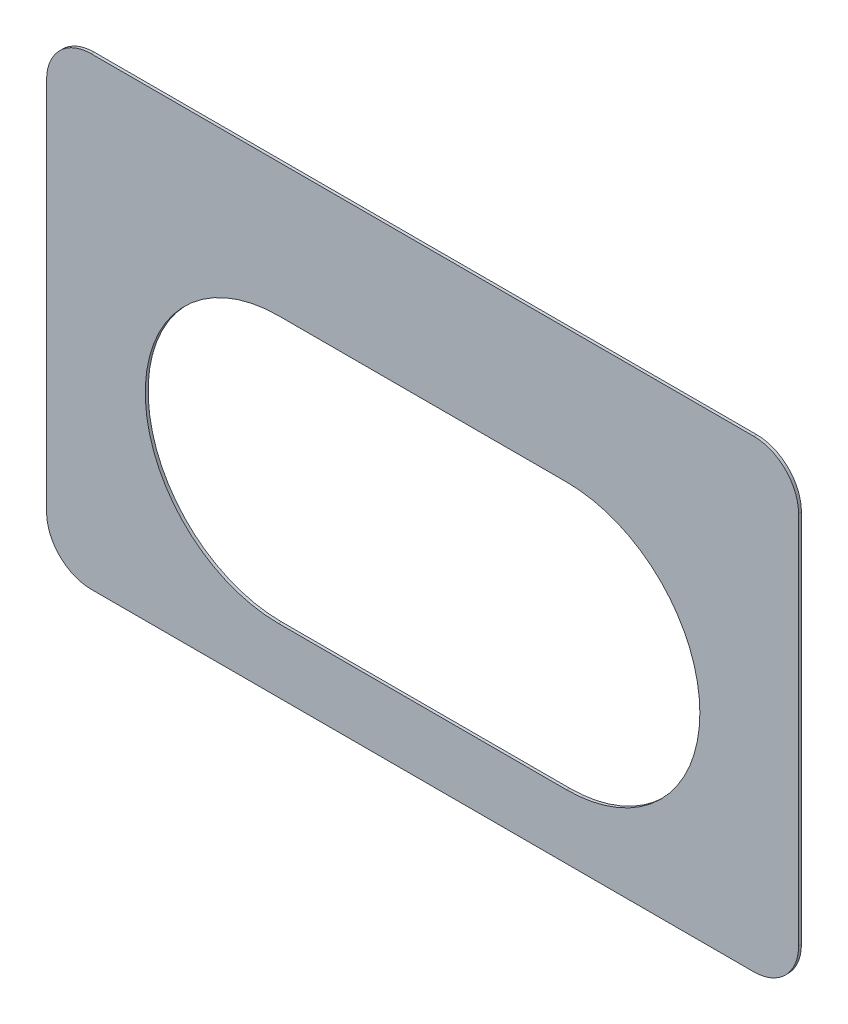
ISO-10303-21;
HEADER;
FILE_DESCRIPTION(('STEP AP214'),'2;1');
FILE_NAME('part.step','',(''),(''),'','','');
FILE_SCHEMA(('AUTOMOTIVE_DESIGN { 1 0 10303 214 1 1 1 1 }'));
ENDSEC;
DATA;
#1=APPLICATION_CONTEXT('core data for automotive mechanical design processes');
#2=APPLICATION_PROTOCOL_DEFINITION('international standard','automotive_design',2000,#1);
#3=PRODUCT_CONTEXT('',#1,'mechanical');
#4=PRODUCT('Part','Part','',(#3));
#5=PRODUCT_RELATED_PRODUCT_CATEGORY('part','',(#4));
#6=PRODUCT_DEFINITION_FORMATION('','',#4);
#7=PRODUCT_DEFINITION_CONTEXT('part definition',#1,'design');
#8=PRODUCT_DEFINITION('design','',#6,#7);
#9=PRODUCT_DEFINITION_SHAPE('','',#8);
#10=(LENGTH_UNIT() NAMED_UNIT(*) SI_UNIT(.MILLI.,.METRE.));
#11=(NAMED_UNIT(*) PLANE_ANGLE_UNIT() SI_UNIT($,.RADIAN.));
#12=(NAMED_UNIT(*) SI_UNIT($,.STERADIAN.) SOLID_ANGLE_UNIT());
#13=UNCERTAINTY_MEASURE_WITH_UNIT(LENGTH_MEASURE(1.E-05),#10,'distance_accuracy_value','');
#14=(GEOMETRIC_REPRESENTATION_CONTEXT(3) GLOBAL_UNCERTAINTY_ASSIGNED_CONTEXT((#13)) GLOBAL_UNIT_ASSIGNED_CONTEXT((#10,
#11,#12)) REPRESENTATION_CONTEXT('',''));
#15=CARTESIAN_POINT('',(0.,0.,0.));
#16=DIRECTION('',(0.,0.,1.));
#17=DIRECTION('',(1.,0.,0.));
#18=AXIS2_PLACEMENT_3D('',#15,#16,#17);
#19=CARTESIAN_POINT('',(12.4999999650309,3.75,8.));
#20=DIRECTION('',(0.,-1.,0.));
#21=DIRECTION('',(-1.,0.,0.));
#22=AXIS2_PLACEMENT_3D('',#19,#20,#21);
#23=PLANE('',#22);
#24=DIRECTION('',(1.,0.,0.));
#25=VECTOR('',#24,1.);
#26=CARTESIAN_POINT('',(12.4999999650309,3.75,8.2));
#27=LINE('',#26,#25);
#28=CARTESIAN_POINT('',(12.4999999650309,3.75,8.2));
#29=VERTEX_POINT('',#28);
#30=CARTESIAN_POINT('',(32.4999999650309,3.75,8.2));
#31=VERTEX_POINT('',#30);
#32=EDGE_CURVE('E242',#29,#31,#27,.T.);
#33=ORIENTED_EDGE('',*,*,#32,.T.);
#34=DIRECTION('',(0.,0.,1.));
#35=VECTOR('',#34,1.);
#36=CARTESIAN_POINT('',(32.4999999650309,3.75,8.));
#37=LINE('',#36,#35);
#38=CARTESIAN_POINT('',(32.4999999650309,3.75,8.));
#39=VERTEX_POINT('',#38);
#40=EDGE_CURVE('E11',#39,#31,#37,.T.);
#41=ORIENTED_EDGE('',*,*,#40,.F.);
#42=DIRECTION('',(1.,0.,0.));
#43=VECTOR('',#42,1.);
#44=CARTESIAN_POINT('',(12.4999999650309,3.75,8.));
#45=LINE('',#44,#43);
#46=CARTESIAN_POINT('',(12.4999999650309,3.75,8.));
#47=VERTEX_POINT('',#46);
#48=EDGE_CURVE('E162',#47,#39,#45,.T.);
#49=ORIENTED_EDGE('',*,*,#48,.F.);
#50=DIRECTION('',(0.,0.,1.));
#51=VECTOR('',#50,1.);
#52=CARTESIAN_POINT('',(12.4999999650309,3.75,8.));
#53=LINE('',#52,#51);
#54=EDGE_CURVE('E47',#47,#29,#53,.T.);
#55=ORIENTED_EDGE('',*,*,#54,.T.);
#56=EDGE_LOOP('',(#33,#41,#49,#55));
#57=FACE_BOUND('',#56,.T.);
#58=ADVANCED_FACE('F17',(#57),#23,.F.);
#59=CARTESIAN_POINT('',(32.4999999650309,13.,8.));
#60=DIRECTION('',(0.,0.,1.));
#61=DIRECTION('',(1.,0.,0.));
#62=AXIS2_PLACEMENT_3D('',#59,#60,#61);
#63=CYLINDRICAL_SURFACE('',#62,9.25);
#64=DIRECTION('',(0.,0.,1.));
#65=VECTOR('',#64,1.);
#66=CARTESIAN_POINT('',(41.7499999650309,13.,8.));
#67=LINE('',#66,#65);
#68=CARTESIAN_POINT('',(41.7499999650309,13.,8.));
#69=VERTEX_POINT('',#68);
#70=CARTESIAN_POINT('',(41.7499999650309,13.,8.2));
#71=VERTEX_POINT('',#70);
#72=EDGE_CURVE('E431',#69,#71,#67,.T.);
#73=ORIENTED_EDGE('',*,*,#72,.F.);
#74=CARTESIAN_POINT('',(32.4999999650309,13.,8.));
#75=DIRECTION('',(0.,0.,1.));
#76=DIRECTION('',(1.,0.,0.));
#77=AXIS2_PLACEMENT_3D('',#74,#75,#76);
#78=CIRCLE('',#77,9.25);
#79=EDGE_CURVE('E187',#39,#69,#78,.T.);
#80=ORIENTED_EDGE('',*,*,#79,.F.);
#81=ORIENTED_EDGE('',*,*,#40,.T.);
#82=CARTESIAN_POINT('',(32.4999999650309,13.,8.2));
#83=DIRECTION('',(0.,0.,1.));
#84=DIRECTION('',(1.,0.,0.));
#85=AXIS2_PLACEMENT_3D('',#82,#83,#84);
#86=CIRCLE('',#85,9.25);
#87=EDGE_CURVE('E239',#31,#71,#86,.T.);
#88=ORIENTED_EDGE('',*,*,#87,.T.);
#89=EDGE_LOOP('',(#73,#80,#81,#88));
#90=FACE_BOUND('',#89,.T.);
#91=ADVANCED_FACE('F19',(#90),#63,.F.);
#92=CARTESIAN_POINT('',(12.4999999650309,22.25,8.));
#93=DIRECTION('',(0.,1.,0.));
#94=DIRECTION('',(1.,0.,0.));
#95=AXIS2_PLACEMENT_3D('',#92,#93,#94);
#96=PLANE('',#95);
#97=DIRECTION('',(-1.,0.,0.));
#98=VECTOR('',#97,1.);
#99=CARTESIAN_POINT('',(12.4999999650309,22.25,8.2));
#100=LINE('',#99,#98);
#101=CARTESIAN_POINT('',(32.4999999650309,22.25,8.2));
#102=VERTEX_POINT('',#101);
#103=CARTESIAN_POINT('',(12.4999999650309,22.25,8.2));
#104=VERTEX_POINT('',#103);
#105=EDGE_CURVE('E151',#102,#104,#100,.T.);
#106=ORIENTED_EDGE('',*,*,#105,.T.);
#107=DIRECTION('',(0.,0.,1.));
#108=VECTOR('',#107,1.);
#109=CARTESIAN_POINT('',(12.4999999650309,22.25,8.));
#110=LINE('',#109,#108);
#111=CARTESIAN_POINT('',(12.4999999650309,22.25,8.));
#112=VERTEX_POINT('',#111);
#113=EDGE_CURVE('E26',#112,#104,#110,.T.);
#114=ORIENTED_EDGE('',*,*,#113,.F.);
#115=DIRECTION('',(-1.,0.,0.));
#116=VECTOR('',#115,1.);
#117=CARTESIAN_POINT('',(12.4999999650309,22.25,8.));
#118=LINE('',#117,#116);
#119=CARTESIAN_POINT('',(32.4999999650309,22.25,8.));
#120=VERTEX_POINT('',#119);
#121=EDGE_CURVE('E149',#120,#112,#118,.T.);
#122=ORIENTED_EDGE('',*,*,#121,.F.);
#123=DIRECTION('',(0.,0.,1.));
#124=VECTOR('',#123,1.);
#125=CARTESIAN_POINT('',(32.4999999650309,22.25,8.));
#126=LINE('',#125,#124);
#127=EDGE_CURVE('E416',#120,#102,#126,.T.);
#128=ORIENTED_EDGE('',*,*,#127,.T.);
#129=EDGE_LOOP('',(#106,#114,#122,#128));
#130=FACE_BOUND('',#129,.T.);
#131=ADVANCED_FACE('F146',(#130),#96,.F.);
#132=CARTESIAN_POINT('',(12.4999999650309,13.,8.));
#133=DIRECTION('',(0.,0.,1.));
#134=DIRECTION('',(1.,0.,0.));
#135=AXIS2_PLACEMENT_3D('',#132,#133,#134);
#136=CYLINDRICAL_SURFACE('',#135,9.25);
#137=CARTESIAN_POINT('',(12.4999999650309,13.,8.2));
#138=DIRECTION('',(0.,0.,1.));
#139=DIRECTION('',(1.,0.,0.));
#140=AXIS2_PLACEMENT_3D('',#137,#138,#139);
#141=CIRCLE('',#140,9.25);
#142=EDGE_CURVE('E234',#104,#29,#141,.T.);
#143=ORIENTED_EDGE('',*,*,#142,.T.);
#144=ORIENTED_EDGE('',*,*,#54,.F.);
#145=CARTESIAN_POINT('',(12.4999999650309,13.,8.));
#146=DIRECTION('',(0.,0.,1.));
#147=DIRECTION('',(1.,0.,0.));
#148=AXIS2_PLACEMENT_3D('',#145,#146,#147);
#149=CIRCLE('',#148,9.25);
#150=EDGE_CURVE('E157',#112,#47,#149,.T.);
#151=ORIENTED_EDGE('',*,*,#150,.F.);
#152=ORIENTED_EDGE('',*,*,#113,.T.);
#153=EDGE_LOOP('',(#143,#144,#151,#152));
#154=FACE_BOUND('',#153,.T.);
#155=ADVANCED_FACE('F158',(#154),#136,.F.);
#156=CARTESIAN_POINT('',(-0.500000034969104,2.4,8.2));
#157=DIRECTION('',(0.,0.,1.));
#158=DIRECTION('',(1.,0.,0.));
#159=AXIS2_PLACEMENT_3D('',#156,#157,#158);
#160=PLANE('',#159);
#161=ORIENTED_EDGE('',*,*,#142,.F.);
#162=ORIENTED_EDGE('',*,*,#105,.F.);
#163=CARTESIAN_POINT('',(32.4999999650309,13.,8.2));
#164=DIRECTION('',(0.,0.,1.));
#165=DIRECTION('',(1.,0.,0.));
#166=AXIS2_PLACEMENT_3D('',#163,#164,#165);
#167=CIRCLE('',#166,9.25);
#168=EDGE_CURVE('E423',#71,#102,#167,.T.);
#169=ORIENTED_EDGE('',*,*,#168,.F.);
#170=ORIENTED_EDGE('',*,*,#87,.F.);
#171=ORIENTED_EDGE('',*,*,#32,.F.);
#172=EDGE_LOOP('',(#161,#162,#169,#170,#171));
#173=FACE_BOUND('',#172,.T.);
#174=DIRECTION('',(1.,0.,0.));
#175=VECTOR('',#174,1.);
#176=CARTESIAN_POINT('',(45.4999999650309,31.5,8.2));
#177=LINE('',#176,#175);
#178=CARTESIAN_POINT('',(-0.500000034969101,31.5,8.2));
#179=VERTEX_POINT('',#178);
#180=CARTESIAN_POINT('',(45.4999999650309,31.5,8.2));
#181=VERTEX_POINT('',#180);
#182=EDGE_CURVE('E198',#179,#181,#177,.T.);
#183=ORIENTED_EDGE('',*,*,#182,.F.);
#184=CARTESIAN_POINT('',(-0.500000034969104,28.4,8.2));
#185=DIRECTION('',(0.,0.,-1.));
#186=DIRECTION('',(1.,0.,0.));
#187=AXIS2_PLACEMENT_3D('',#184,#185,#186);
#188=CIRCLE('',#187,3.1);
#189=CARTESIAN_POINT('',(-3.6000000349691,28.4,8.2));
#190=VERTEX_POINT('',#189);
#191=EDGE_CURVE('E194',#190,#179,#188,.T.);
#192=ORIENTED_EDGE('',*,*,#191,.F.);
#193=DIRECTION('',(0.,1.,0.));
#194=VECTOR('',#193,1.);
#195=CARTESIAN_POINT('',(-3.6000000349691,28.4,8.2));
#196=LINE('',#195,#194);
#197=CARTESIAN_POINT('',(-3.6000000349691,2.4,8.2));
#198=VERTEX_POINT('',#197);
#199=EDGE_CURVE('E186',#198,#190,#196,.T.);
#200=ORIENTED_EDGE('',*,*,#199,.F.);
#201=CARTESIAN_POINT('',(-0.500000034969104,2.4,8.2));
#202=DIRECTION('',(0.,0.,-1.));
#203=DIRECTION('',(1.,0.,0.));
#204=AXIS2_PLACEMENT_3D('',#201,#202,#203);
#205=CIRCLE('',#204,3.1);
#206=CARTESIAN_POINT('',(-0.500000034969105,-0.699999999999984,8.2));
#207=VERTEX_POINT('',#206);
#208=EDGE_CURVE('E231',#207,#198,#205,.T.);
#209=ORIENTED_EDGE('',*,*,#208,.F.);
#210=DIRECTION('',(-1.,0.,0.));
#211=VECTOR('',#210,1.);
#212=CARTESIAN_POINT('',(-0.500000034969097,-0.699999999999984,8.2));
#213=LINE('',#212,#211);
#214=CARTESIAN_POINT('',(45.4999999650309,-0.69999999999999,8.2));
#215=VERTEX_POINT('',#214);
#216=EDGE_CURVE('E224',#215,#207,#213,.T.);
#217=ORIENTED_EDGE('',*,*,#216,.F.);
#218=CARTESIAN_POINT('',(45.4999999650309,2.4,8.2));
#219=DIRECTION('',(0.,0.,-1.));
#220=DIRECTION('',(1.,0.,0.));
#221=AXIS2_PLACEMENT_3D('',#218,#219,#220);
#222=CIRCLE('',#221,3.1);
#223=CARTESIAN_POINT('',(48.5999999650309,2.4,8.2));
#224=VERTEX_POINT('',#223);
#225=EDGE_CURVE('E213',#224,#215,#222,.T.);
#226=ORIENTED_EDGE('',*,*,#225,.F.);
#227=DIRECTION('',(0.,-1.,0.));
#228=VECTOR('',#227,1.);
#229=CARTESIAN_POINT('',(48.5999999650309,2.4,8.2));
#230=LINE('',#229,#228);
#231=CARTESIAN_POINT('',(48.5999999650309,28.4,8.2));
#232=VERTEX_POINT('',#231);
#233=EDGE_CURVE('E214',#232,#224,#230,.T.);
#234=ORIENTED_EDGE('',*,*,#233,.F.);
#235=CARTESIAN_POINT('',(45.4999999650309,28.4,8.2));
#236=DIRECTION('',(0.,0.,-1.));
#237=DIRECTION('',(1.,0.,0.));
#238=AXIS2_PLACEMENT_3D('',#235,#236,#237);
#239=CIRCLE('',#238,3.1);
#240=EDGE_CURVE('E205',#181,#232,#239,.T.);
#241=ORIENTED_EDGE('',*,*,#240,.F.);
#242=EDGE_LOOP('',(#183,#192,#200,#209,#217,#226,#234,#241));
#243=FACE_BOUND('',#242,.T.);
#244=ADVANCED_FACE('F471',(#173,#243),#160,.T.);
#245=CARTESIAN_POINT('',(-0.500000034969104,2.4,8.));
#246=DIRECTION('',(0.,0.,1.));
#247=DIRECTION('',(1.,0.,0.));
#248=AXIS2_PLACEMENT_3D('',#245,#246,#247);
#249=CYLINDRICAL_SURFACE('',#248,3.1);
#250=CARTESIAN_POINT('',(-0.500000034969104,2.4,8.));
#251=DIRECTION('',(0.,0.,1.));
#252=DIRECTION('',(1.,0.,0.));
#253=AXIS2_PLACEMENT_3D('',#250,#251,#252);
#254=CIRCLE('',#253,3.1);
#255=CARTESIAN_POINT('',(-3.6000000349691,2.4,8.));
#256=VERTEX_POINT('',#255);
#257=CARTESIAN_POINT('',(-0.500000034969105,-0.699999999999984,8.));
#258=VERTEX_POINT('',#257);
#259=EDGE_CURVE('E177',#256,#258,#254,.T.);
#260=ORIENTED_EDGE('',*,*,#259,.T.);
#261=DIRECTION('',(0.,0.,-1.));
#262=VECTOR('',#261,1.);
#263=CARTESIAN_POINT('',(-0.500000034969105,-0.699999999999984,8.));
#264=LINE('',#263,#262);
#265=EDGE_CURVE('E228',#207,#258,#264,.T.);
#266=ORIENTED_EDGE('',*,*,#265,.F.);
#267=ORIENTED_EDGE('',*,*,#208,.T.);
#268=DIRECTION('',(0.,0.,1.));
#269=VECTOR('',#268,1.);
#270=CARTESIAN_POINT('',(-3.6000000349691,2.4,8.));
#271=LINE('',#270,#269);
#272=EDGE_CURVE('E182',#256,#198,#271,.T.);
#273=ORIENTED_EDGE('',*,*,#272,.F.);
#274=EDGE_LOOP('',(#260,#266,#267,#273));
#275=FACE_BOUND('',#274,.T.);
#276=ADVANCED_FACE('F483',(#275),#249,.T.);
#277=CARTESIAN_POINT('',(-0.500000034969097,-0.699999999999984,8.));
#278=DIRECTION('',(0.,-1.,0.));
#279=DIRECTION('',(-1.,0.,0.));
#280=AXIS2_PLACEMENT_3D('',#277,#278,#279);
#281=PLANE('',#280);
#282=DIRECTION('',(1.,0.,0.));
#283=VECTOR('',#282,1.);
#284=CARTESIAN_POINT('',(-0.500000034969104,-0.699999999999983,8.));
#285=LINE('',#284,#283);
#286=CARTESIAN_POINT('',(45.4999999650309,-0.699999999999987,8.));
#287=VERTEX_POINT('',#286);
#288=EDGE_CURVE('E370',#258,#287,#285,.T.);
#289=ORIENTED_EDGE('',*,*,#288,.T.);
#290=DIRECTION('',(0.,0.,-1.));
#291=VECTOR('',#290,1.);
#292=CARTESIAN_POINT('',(45.4999999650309,-0.69999999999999,8.));
#293=LINE('',#292,#291);
#294=EDGE_CURVE('E221',#215,#287,#293,.T.);
#295=ORIENTED_EDGE('',*,*,#294,.F.);
#296=ORIENTED_EDGE('',*,*,#216,.T.);
#297=ORIENTED_EDGE('',*,*,#265,.T.);
#298=EDGE_LOOP('',(#289,#295,#296,#297));
#299=FACE_BOUND('',#298,.T.);
#300=ADVANCED_FACE('F488',(#299),#281,.T.);
#301=CARTESIAN_POINT('',(45.4999999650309,2.4,8.));
#302=DIRECTION('',(0.,0.,1.));
#303=DIRECTION('',(1.,0.,0.));
#304=AXIS2_PLACEMENT_3D('',#301,#302,#303);
#305=CYLINDRICAL_SURFACE('',#304,3.1);
#306=CARTESIAN_POINT('',(45.4999999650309,2.4,8.));
#307=DIRECTION('',(0.,0.,1.));
#308=DIRECTION('',(1.,0.,0.));
#309=AXIS2_PLACEMENT_3D('',#306,#307,#308);
#310=CIRCLE('',#309,3.1);
#311=CARTESIAN_POINT('',(48.5999999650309,2.4,8.));
#312=VERTEX_POINT('',#311);
#313=EDGE_CURVE('E378',#287,#312,#310,.T.);
#314=ORIENTED_EDGE('',*,*,#313,.T.);
#315=DIRECTION('',(0.,0.,-1.));
#316=VECTOR('',#315,1.);
#317=CARTESIAN_POINT('',(48.5999999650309,2.4,8.));
#318=LINE('',#317,#316);
#319=EDGE_CURVE('E210',#224,#312,#318,.T.);
#320=ORIENTED_EDGE('',*,*,#319,.F.);
#321=ORIENTED_EDGE('',*,*,#225,.T.);
#322=ORIENTED_EDGE('',*,*,#294,.T.);
#323=EDGE_LOOP('',(#314,#320,#321,#322));
#324=FACE_BOUND('',#323,.T.);
#325=ADVANCED_FACE('F484',(#324),#305,.T.);
#326=CARTESIAN_POINT('',(48.5999999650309,2.4,8.));
#327=DIRECTION('',(1.,0.,0.));
#328=DIRECTION('',(0.,1.,0.));
#329=AXIS2_PLACEMENT_3D('',#326,#327,#328);
#330=PLANE('',#329);
#331=DIRECTION('',(0.,1.,0.));
#332=VECTOR('',#331,1.);
#333=CARTESIAN_POINT('',(48.5999999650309,2.4,8.));
#334=LINE('',#333,#332);
#335=CARTESIAN_POINT('',(48.5999999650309,28.4,8.));
#336=VERTEX_POINT('',#335);
#337=EDGE_CURVE('E386',#312,#336,#334,.T.);
#338=ORIENTED_EDGE('',*,*,#337,.T.);
#339=DIRECTION('',(0.,0.,-1.));
#340=VECTOR('',#339,1.);
#341=CARTESIAN_POINT('',(48.5999999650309,28.4,8.));
#342=LINE('',#341,#340);
#343=EDGE_CURVE('E209',#232,#336,#342,.T.);
#344=ORIENTED_EDGE('',*,*,#343,.F.);
#345=ORIENTED_EDGE('',*,*,#233,.T.);
#346=ORIENTED_EDGE('',*,*,#319,.T.);
#347=EDGE_LOOP('',(#338,#344,#345,#346));
#348=FACE_BOUND('',#347,.T.);
#349=ADVANCED_FACE('F487',(#348),#330,.T.);
#350=CARTESIAN_POINT('',(45.4999999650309,28.4,8.));
#351=DIRECTION('',(0.,0.,1.));
#352=DIRECTION('',(1.,0.,0.));
#353=AXIS2_PLACEMENT_3D('',#350,#351,#352);
#354=CYLINDRICAL_SURFACE('',#353,3.1);
#355=CARTESIAN_POINT('',(45.4999999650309,28.4,8.));
#356=DIRECTION('',(0.,0.,1.));
#357=DIRECTION('',(1.,0.,0.));
#358=AXIS2_PLACEMENT_3D('',#355,#356,#357);
#359=CIRCLE('',#358,3.1);
#360=CARTESIAN_POINT('',(45.4999999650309,31.5,8.));
#361=VERTEX_POINT('',#360);
#362=EDGE_CURVE('E393',#336,#361,#359,.T.);
#363=ORIENTED_EDGE('',*,*,#362,.T.);
#364=DIRECTION('',(0.,0.,-1.));
#365=VECTOR('',#364,1.);
#366=CARTESIAN_POINT('',(45.4999999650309,31.5,8.));
#367=LINE('',#366,#365);
#368=EDGE_CURVE('E202',#181,#361,#367,.T.);
#369=ORIENTED_EDGE('',*,*,#368,.F.);
#370=ORIENTED_EDGE('',*,*,#240,.T.);
#371=ORIENTED_EDGE('',*,*,#343,.T.);
#372=EDGE_LOOP('',(#363,#369,#370,#371));
#373=FACE_BOUND('',#372,.T.);
#374=ADVANCED_FACE('F507',(#373),#354,.T.);
#375=CARTESIAN_POINT('',(45.4999999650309,31.5,8.));
#376=DIRECTION('',(0.,1.,0.));
#377=DIRECTION('',(1.,0.,0.));
#378=AXIS2_PLACEMENT_3D('',#375,#376,#377);
#379=PLANE('',#378);
#380=DIRECTION('',(-1.,0.,0.));
#381=VECTOR('',#380,1.);
#382=CARTESIAN_POINT('',(-0.500000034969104,31.5,8.));
#383=LINE('',#382,#381);
#384=CARTESIAN_POINT('',(-0.500000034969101,31.5,8.));
#385=VERTEX_POINT('',#384);
#386=EDGE_CURVE('E400',#361,#385,#383,.T.);
#387=ORIENTED_EDGE('',*,*,#386,.T.);
#388=DIRECTION('',(0.,0.,-1.));
#389=VECTOR('',#388,1.);
#390=CARTESIAN_POINT('',(-0.500000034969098,31.5,8.));
#391=LINE('',#390,#389);
#392=EDGE_CURVE('E195',#179,#385,#391,.T.);
#393=ORIENTED_EDGE('',*,*,#392,.F.);
#394=ORIENTED_EDGE('',*,*,#182,.T.);
#395=ORIENTED_EDGE('',*,*,#368,.T.);
#396=EDGE_LOOP('',(#387,#393,#394,#395));
#397=FACE_BOUND('',#396,.T.);
#398=ADVANCED_FACE('F503',(#397),#379,.T.);
#399=CARTESIAN_POINT('',(-0.500000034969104,28.4,8.));
#400=DIRECTION('',(0.,0.,1.));
#401=DIRECTION('',(1.,0.,0.));
#402=AXIS2_PLACEMENT_3D('',#399,#400,#401);
#403=CYLINDRICAL_SURFACE('',#402,3.1);
#404=CARTESIAN_POINT('',(-0.500000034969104,28.4,8.));
#405=DIRECTION('',(0.,0.,1.));
#406=DIRECTION('',(1.,0.,0.));
#407=AXIS2_PLACEMENT_3D('',#404,#405,#406);
#408=CIRCLE('',#407,3.1);
#409=CARTESIAN_POINT('',(-3.6000000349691,28.4,8.));
#410=VERTEX_POINT('',#409);
#411=EDGE_CURVE('E408',#385,#410,#408,.T.);
#412=ORIENTED_EDGE('',*,*,#411,.T.);
#413=DIRECTION('',(0.,0.,-1.));
#414=VECTOR('',#413,1.);
#415=CARTESIAN_POINT('',(-3.6000000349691,28.4,8.));
#416=LINE('',#415,#414);
#417=EDGE_CURVE('E191',#190,#410,#416,.T.);
#418=ORIENTED_EDGE('',*,*,#417,.F.);
#419=ORIENTED_EDGE('',*,*,#191,.T.);
#420=ORIENTED_EDGE('',*,*,#392,.T.);
#421=EDGE_LOOP('',(#412,#418,#419,#420));
#422=FACE_BOUND('',#421,.T.);
#423=ADVANCED_FACE('F497',(#422),#403,.T.);
#424=CARTESIAN_POINT('',(-3.6000000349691,28.4,8.));
#425=DIRECTION('',(-1.,0.,0.));
#426=DIRECTION('',(0.,0.,1.));
#427=AXIS2_PLACEMENT_3D('',#424,#425,#426);
#428=PLANE('',#427);
#429=DIRECTION('',(0.,-1.,0.));
#430=VECTOR('',#429,1.);
#431=CARTESIAN_POINT('',(-3.6000000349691,2.4,8.));
#432=LINE('',#431,#430);
#433=EDGE_CURVE('E170',#410,#256,#432,.T.);
#434=ORIENTED_EDGE('',*,*,#433,.T.);
#435=ORIENTED_EDGE('',*,*,#272,.T.);
#436=ORIENTED_EDGE('',*,*,#199,.T.);
#437=ORIENTED_EDGE('',*,*,#417,.T.);
#438=EDGE_LOOP('',(#434,#435,#436,#437));
#439=FACE_BOUND('',#438,.T.);
#440=ADVANCED_FACE('F494',(#439),#428,.T.);
#441=CARTESIAN_POINT('',(-0.500000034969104,2.4,8.));
#442=DIRECTION('',(0.,0.,1.));
#443=DIRECTION('',(1.,0.,0.));
#444=AXIS2_PLACEMENT_3D('',#441,#442,#443);
#445=PLANE('',#444);
#446=ORIENTED_EDGE('',*,*,#121,.T.);
#447=ORIENTED_EDGE('',*,*,#150,.T.);
#448=ORIENTED_EDGE('',*,*,#48,.T.);
#449=ORIENTED_EDGE('',*,*,#79,.T.);
#450=CARTESIAN_POINT('',(32.4999999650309,13.,8.));
#451=DIRECTION('',(0.,0.,1.));
#452=DIRECTION('',(1.,0.,0.));
#453=AXIS2_PLACEMENT_3D('',#450,#451,#452);
#454=CIRCLE('',#453,9.25);
#455=EDGE_CURVE('E168',#69,#120,#454,.T.);
#456=ORIENTED_EDGE('',*,*,#455,.T.);
#457=EDGE_LOOP('',(#446,#447,#448,#449,#456));
#458=FACE_BOUND('',#457,.T.);
#459=ORIENTED_EDGE('',*,*,#411,.F.);
#460=ORIENTED_EDGE('',*,*,#386,.F.);
#461=ORIENTED_EDGE('',*,*,#362,.F.);
#462=ORIENTED_EDGE('',*,*,#337,.F.);
#463=ORIENTED_EDGE('',*,*,#313,.F.);
#464=ORIENTED_EDGE('',*,*,#288,.F.);
#465=ORIENTED_EDGE('',*,*,#259,.F.);
#466=ORIENTED_EDGE('',*,*,#433,.F.);
#467=EDGE_LOOP('',(#459,#460,#461,#462,#463,#464,#465,#466));
#468=FACE_BOUND('',#467,.T.);
#469=ADVANCED_FACE('F165',(#458,#468),#445,.F.);
#470=CARTESIAN_POINT('',(32.4999999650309,13.,8.));
#471=DIRECTION('',(0.,0.,1.));
#472=DIRECTION('',(1.,0.,0.));
#473=AXIS2_PLACEMENT_3D('',#470,#471,#472);
#474=CYLINDRICAL_SURFACE('',#473,9.25);
#475=ORIENTED_EDGE('',*,*,#455,.F.);
#476=ORIENTED_EDGE('',*,*,#72,.T.);
#477=ORIENTED_EDGE('',*,*,#168,.T.);
#478=ORIENTED_EDGE('',*,*,#127,.F.);
#479=EDGE_LOOP('',(#475,#476,#477,#478));
#480=FACE_BOUND('',#479,.T.);
#481=ADVANCED_FACE('F467',(#480),#474,.F.);
#482=CLOSED_SHELL('',(#58,#91,#131,#155,#244,#276,#300,#325,#349,#374,#398,#423,#440,#469,#481));
#483=MANIFOLD_SOLID_BREP('B1',#482);
#484=ADVANCED_BREP_SHAPE_REPRESENTATION('',(#18,#483),#14);
#485=SHAPE_DEFINITION_REPRESENTATION(#9,#484);
ENDSEC;
END-ISO-10303-21;
